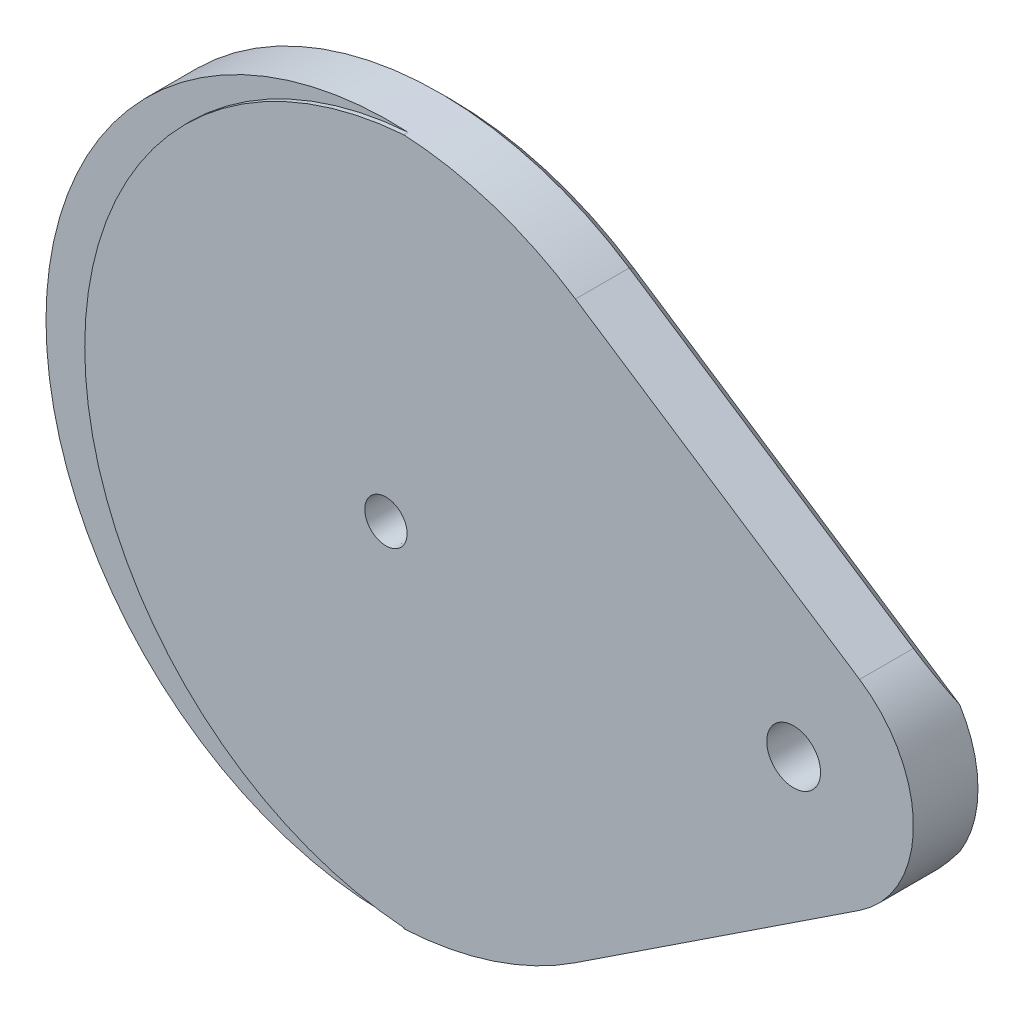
from build123d import *

# Parameters (mm, degrees)
SKETCH1_R          = 5.55625
SKETCH1_R_2        = 7.9375
BASE_EXTRUDE_DEPTH = 19.05
CUT_EXTRUDE2_DEPTH = 1.27


with BuildPart() as part:
    # Sketch1 → Base-Extrude (new body)
    with BuildSketch(Plane.XY):
        with BuildLine():
            Line((55.936837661, 84.815270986), (139.785819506, 29.515714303))
            ThreePointArc((139.785819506, 29.515714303), (155.6766, 0), (139.785819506, -29.515714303))
            Line((139.785819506, -29.515714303), (55.936837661, -84.815270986))
            ThreePointArc((55.936837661, -84.815270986), (-101.6, 0), (55.936837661, 84.815270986))
        make_face()
        with Locations(Location((0, 0, 0), (0, 0, 180))):
            Circle(SKETCH1_R, mode=Mode.SUBTRACT)
        with Locations(Location((120.3198, 0, 0), (0, 0, 180))):
            Circle(SKETCH1_R_2, mode=Mode.SUBTRACT)
    extrude(amount=BASE_EXTRUDE_DEPTH)

    # Sketch9 → Cut-Extrude2 (cut)
    with BuildSketch(Plane.XY.offset(19.05)):
        with BuildLine():
            Line((5.273320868, 101.460631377), (5.273320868, 108.91858799))
            ThreePointArc((5.273320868, 108.91858799), (-109.04616785, 0), (5.273320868, -108.91858799))
            Line((5.273320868, -108.91858799), (5.273320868, -101.460631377))
            Line((5.273320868, -101.460631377), (5.25951137, -101.194931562))
            ThreePointArc((5.25951137, -101.194931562), (-88.900085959, 0.139266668), (5.273320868, 101.460631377))
        make_face()
    extrude(amount=-CUT_EXTRUDE2_DEPTH, mode=Mode.SUBTRACT)

    # Cut-Sweep4: sweep along a path in Sketch11
    with BuildLine(Plane(origin=(0, 0, 0), x_dir=(-1, 0, 0), z_dir=(0, 0, -1))) as cut_sweep4_path:
        Line((-165.355789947, -8.848642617), (-138.037793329, -26.865237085))
        Line((-138.037793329, -26.865237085), (-54.188811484, -82.164793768))
        ThreePointArc((-54.188811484, -82.164793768), (98.425, 0), (-54.188811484, 82.164793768))
        Line((-54.188811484, 82.164793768), (-138.037793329, 26.865237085))
        Line((-138.037793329, 26.865237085), (-165.355789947, 8.848642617))
        Line((-165.355789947, 8.848642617), (-180.445428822, -1.103181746))
    # Sketch15 → Cut-Sweep4 (sweep, cut)
    with BuildSketch(Plane(origin=(126.256617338, -83.267975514, 0), x_dir=(0, 0, 1), z_dir=(-0.8347959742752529, 0.5505594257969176, 0))):
        Polygon((-1.916206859, 98.425), (0, 98.425), (3.175, 101.6), (3.175, 102.580398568), (-1.916206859, 102.580398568), align=None)
    sweep(path=cut_sweep4_path.line, mode=Mode.SUBTRACT)

    # Sketch7 → Cut-Revolve3 (revolve, cut)
    with BuildSketch(Plane(origin=(0, 0, 0), x_dir=(-1, 0, 0), z_dir=(0, 0, -1))):
        with BuildLine():
            Line((-123.4948, -19.05), (-123.4948, -7.274838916))
            Line((-123.4948, -7.274838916), (-123.4948, 7.274838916))
            Line((-123.4948, 7.274838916), (-123.4948, 19.05))
            ThreePointArc((-123.4948, 19.05), (-122.56486403, 21.29506403), (-120.3198, 22.225))
            Line((-120.3198, 22.225), (-120.3198, 19.05))
            Line((-120.3198, 19.05), (-120.3198, -22.225))
            ThreePointArc((-120.3198, -22.225), (-122.56486403, -21.29506403), (-123.4948, -19.05))
        make_face()
    revolve(axis=Axis((120.3198, -22.225, 0), (0, -1, 0)), mode=Mode.SUBTRACT)

    # Sketch16 → Cut-Revolve4 (revolve, cut)
    with BuildSketch(Plane(origin=(0, 0, 0), x_dir=(-1, 0, 0), z_dir=(0, 1, 0))):
        Polygon((0, 0), (0, 9.525), (82.55, 0), align=None)
    revolve(axis=Axis((0, 0, 0), (0, 0, 1)), mode=Mode.SUBTRACT)

    # Sketch17 → 1_4 NPT Tapped Hole1 (revolve, cut)
    with BuildSketch(Plane(origin=(0, 0, 19.05), x_dir=(0, -1, 0), z_dir=(1, 0, 0))):
        Polygon((0, 0), (0, 20.436547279), (5.5626, 17.0942), (5.5626, 10.033), (5.943680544, 10.033), (6.244082, 0), align=None)
    revolve(axis=Axis((0, 0, 25.4), (0, 0, -1)), mode=Mode.SUBTRACT)


solid = part.part
